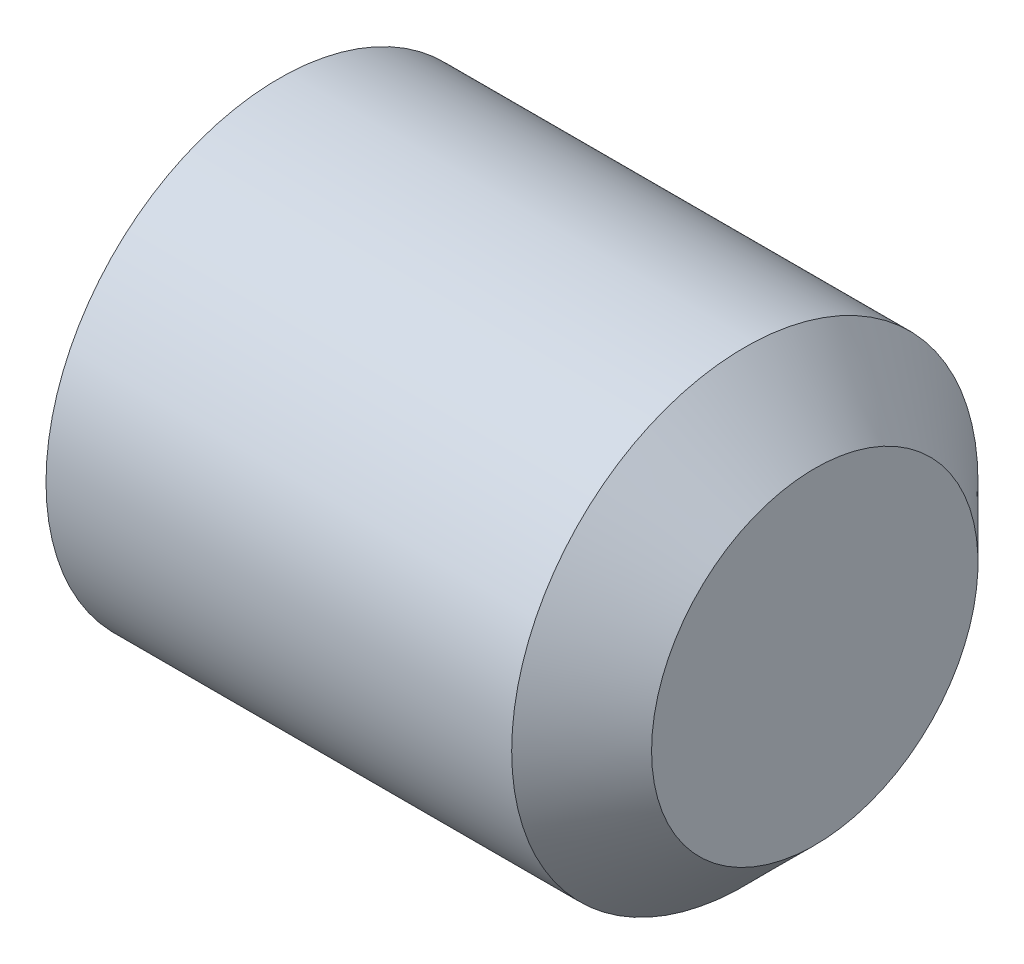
from build123d import *

# Parameters (mm, degrees)
HEX_2_DEPTH = 2


with BuildPart() as part:
    # BodySke → BaseBody (revolve)
    with BuildSketch(Plane.XY, mode=Mode.PRIVATE) as basebody_sk:
        Polygon((0, 0), (0, 2.055), (0.25692087, 2.5), (5.25, 2.5), (6, 1.75), (6, 0), align=None)
    revolve(basebody_sk.sketch.rotate(Axis((-12.7, 0, 0), (1, 0, 0)), 90), axis=Axis((-12.7, 0, 0), (1, 0, 0)))

    # Sketch2 → Hex 2 (cut)
    with BuildSketch(Plane.ZY):
        Polygon((0.721687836, 1.25), (-0.721687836, 1.25), (-1.443375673, 0), (-0.721687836, -1.25), (0.721687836, -1.25), (1.443375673, 0), align=None)
    extrude(amount=-HEX_2_DEPTH, mode=Mode.SUBTRACT)


solid = part.part
